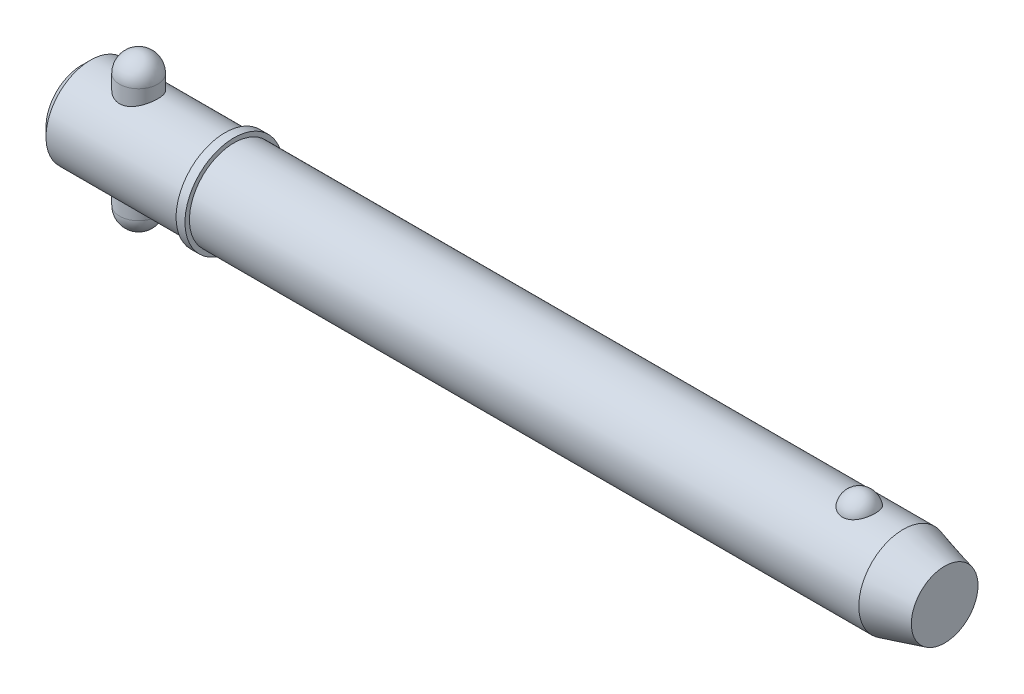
ISO-10303-21;
HEADER;
FILE_DESCRIPTION(('STEP AP214'),'2;1');
FILE_NAME('part.step','',(''),(''),'','','');
FILE_SCHEMA(('AUTOMOTIVE_DESIGN { 1 0 10303 214 1 1 1 1 }'));
ENDSEC;
DATA;
#1=APPLICATION_CONTEXT('core data for automotive mechanical design processes');
#2=APPLICATION_PROTOCOL_DEFINITION('international standard','automotive_design',2000,#1);
#3=PRODUCT_CONTEXT('',#1,'mechanical');
#4=PRODUCT('Part','Part','',(#3));
#5=PRODUCT_RELATED_PRODUCT_CATEGORY('part','',(#4));
#6=PRODUCT_DEFINITION_FORMATION('','',#4);
#7=PRODUCT_DEFINITION_CONTEXT('part definition',#1,'design');
#8=PRODUCT_DEFINITION('design','',#6,#7);
#9=PRODUCT_DEFINITION_SHAPE('','',#8);
#10=(LENGTH_UNIT() NAMED_UNIT(*) SI_UNIT(.MILLI.,.METRE.));
#11=(NAMED_UNIT(*) PLANE_ANGLE_UNIT() SI_UNIT($,.RADIAN.));
#12=(NAMED_UNIT(*) SI_UNIT($,.STERADIAN.) SOLID_ANGLE_UNIT());
#13=UNCERTAINTY_MEASURE_WITH_UNIT(LENGTH_MEASURE(1.E-05),#10,'distance_accuracy_value','');
#14=(GEOMETRIC_REPRESENTATION_CONTEXT(3) GLOBAL_UNCERTAINTY_ASSIGNED_CONTEXT((#13)) GLOBAL_UNIT_ASSIGNED_CONTEXT((#10,
#11,#12)) REPRESENTATION_CONTEXT('',''));
#15=CARTESIAN_POINT('',(0.,0.,0.));
#16=DIRECTION('',(0.,0.,1.));
#17=DIRECTION('',(1.,0.,0.));
#18=AXIS2_PLACEMENT_3D('',#15,#16,#17);
#19=CARTESIAN_POINT('',(14.28,19.05,0.));
#20=DIRECTION('',(0.,-1.,0.));
#21=DIRECTION('',(0.,0.,-1.));
#22=AXIS2_PLACEMENT_3D('',#19,#20,#21);
#23=CYLINDRICAL_SURFACE('',#22,4.76);
#24=CARTESIAN_POINT('',(14.28,-14.29,0.));
#25=DIRECTION('',(0.,-1.,0.));
#26=DIRECTION('',(0.,0.,-1.));
#27=AXIS2_PLACEMENT_3D('',#24,#25,#26);
#28=CIRCLE('',#27,4.76);
#29=CARTESIAN_POINT('',(14.28,-14.29,-4.76));
#30=VERTEX_POINT('',#29);
#31=EDGE_CURVE('P0_E10',#30,#30,#28,.F.);
#32=CARTESIAN_POINT('',(14.28,14.29,0.));
#33=DIRECTION('',(0.,-1.,0.));
#34=DIRECTION('',(0.,0.,-1.));
#35=AXIS2_PLACEMENT_3D('',#32,#33,#34);
#36=CIRCLE('',#35,4.76);
#37=CARTESIAN_POINT('',(14.28,14.29,-4.76));
#38=VERTEX_POINT('',#37);
#39=EDGE_CURVE('P0_E21',#38,#38,#36,.T.);
#40=CARTESIAN_POINT('',(14.28,-14.29,-4.76));
#41=CARTESIAN_POINT('',(14.28,-13.9922916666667,-4.76));
#42=CARTESIAN_POINT('',(14.28,-13.6945833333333,-4.76));
#43=CARTESIAN_POINT('',(14.28,-13.0991666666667,-4.76));
#44=CARTESIAN_POINT('',(14.28,-12.8014583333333,-4.76));
#45=CARTESIAN_POINT('',(14.28,-12.2060416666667,-4.76));
#46=CARTESIAN_POINT('',(14.28,-11.9083333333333,-4.76));
#47=CARTESIAN_POINT('',(14.28,-11.3129166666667,-4.76));
#48=CARTESIAN_POINT('',(14.28,-11.0152083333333,-4.76));
#49=CARTESIAN_POINT('',(14.28,-10.4197916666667,-4.76));
#50=CARTESIAN_POINT('',(14.28,-10.1220833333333,-4.76));
#51=CARTESIAN_POINT('',(14.28,-9.52666666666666,-4.76));
#52=CARTESIAN_POINT('',(14.28,-9.22895833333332,-4.76));
#53=CARTESIAN_POINT('',(14.28,-8.63354166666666,-4.76));
#54=CARTESIAN_POINT('',(14.28,-8.33583333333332,-4.76));
#55=CARTESIAN_POINT('',(14.28,-7.74041666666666,-4.76));
#56=CARTESIAN_POINT('',(14.28,-7.44270833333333,-4.76));
#57=CARTESIAN_POINT('',(14.28,-6.84729166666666,-4.76));
#58=CARTESIAN_POINT('',(14.28,-6.54958333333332,-4.76));
#59=CARTESIAN_POINT('',(14.28,-5.95416666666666,-4.76));
#60=CARTESIAN_POINT('',(14.28,-5.65645833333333,-4.76));
#61=CARTESIAN_POINT('',(14.28,-5.06104166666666,-4.76));
#62=CARTESIAN_POINT('',(14.28,-4.76333333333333,-4.76));
#63=CARTESIAN_POINT('',(14.28,-4.16791666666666,-4.76));
#64=CARTESIAN_POINT('',(14.28,-3.87020833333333,-4.76));
#65=CARTESIAN_POINT('',(14.28,-3.27479166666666,-4.76));
#66=CARTESIAN_POINT('',(14.28,-2.97708333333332,-4.76));
#67=CARTESIAN_POINT('',(14.28,-2.38166666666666,-4.76));
#68=CARTESIAN_POINT('',(14.28,-2.08395833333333,-4.76));
#69=CARTESIAN_POINT('',(14.28,-1.48854166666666,-4.76));
#70=CARTESIAN_POINT('',(14.28,-1.19083333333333,-4.76));
#71=CARTESIAN_POINT('',(14.28,-0.595416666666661,-4.76));
#72=CARTESIAN_POINT('',(14.28,-0.297708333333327,-4.76));
#73=CARTESIAN_POINT('',(14.28,0.297708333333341,-4.76));
#74=CARTESIAN_POINT('',(14.28,0.595416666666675,-4.76));
#75=CARTESIAN_POINT('',(14.28,1.19083333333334,-4.76));
#76=CARTESIAN_POINT('',(14.28,1.48854166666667,-4.76));
#77=CARTESIAN_POINT('',(14.28,2.08395833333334,-4.76));
#78=CARTESIAN_POINT('',(14.28,2.38166666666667,-4.76));
#79=CARTESIAN_POINT('',(14.28,2.97708333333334,-4.76));
#80=CARTESIAN_POINT('',(14.28,3.27479166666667,-4.76));
#81=CARTESIAN_POINT('',(14.28,3.87020833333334,-4.76));
#82=CARTESIAN_POINT('',(14.28,4.16791666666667,-4.76));
#83=CARTESIAN_POINT('',(14.28,4.76333333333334,-4.76));
#84=CARTESIAN_POINT('',(14.28,5.06104166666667,-4.76));
#85=CARTESIAN_POINT('',(14.28,5.65645833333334,-4.76));
#86=CARTESIAN_POINT('',(14.28,5.95416666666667,-4.76));
#87=CARTESIAN_POINT('',(14.28,6.54958333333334,-4.76));
#88=CARTESIAN_POINT('',(14.28,6.84729166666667,-4.76));
#89=CARTESIAN_POINT('',(14.28,7.44270833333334,-4.76));
#90=CARTESIAN_POINT('',(14.28,7.74041666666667,-4.76));
#91=CARTESIAN_POINT('',(14.28,8.33583333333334,-4.76));
#92=CARTESIAN_POINT('',(14.28,8.63354166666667,-4.76));
#93=CARTESIAN_POINT('',(14.28,9.22895833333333,-4.76));
#94=CARTESIAN_POINT('',(14.28,9.52666666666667,-4.76));
#95=CARTESIAN_POINT('',(14.28,10.1220833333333,-4.76));
#96=CARTESIAN_POINT('',(14.28,10.4197916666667,-4.76));
#97=CARTESIAN_POINT('',(14.28,11.0152083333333,-4.76));
#98=CARTESIAN_POINT('',(14.28,11.3129166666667,-4.76));
#99=CARTESIAN_POINT('',(14.28,11.9083333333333,-4.76));
#100=CARTESIAN_POINT('',(14.28,12.2060416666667,-4.76));
#101=CARTESIAN_POINT('',(14.28,12.8014583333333,-4.76));
#102=CARTESIAN_POINT('',(14.28,13.0991666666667,-4.76));
#103=CARTESIAN_POINT('',(14.28,13.6945833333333,-4.76));
#104=CARTESIAN_POINT('',(14.28,13.9922916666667,-4.76));
#105=CARTESIAN_POINT('',(14.28,14.29,-4.76));
#106=B_SPLINE_CURVE_WITH_KNOTS('',3,(#40,#41,#42,#43,#44,#45,#46,#47,#48,#49,#50,#51,#52,#53,
#54,#55,#56,#57,#58,#59,#60,#61,#62,#63,#64,#65,#66,#67,#68,#69,#70,#71,#72,#73,#74,#75,#76,#77,
#78,#79,#80,#81,#82,#83,#84,#85,#86,#87,#88,#89,#90,#91,#92,#93,#94,#95,#96,#97,#98,#99,#100,
#101,#102,#103,#104,#105),.UNSPECIFIED.,.F.,.F.,(4,2,2,2,2,2,2,2,2,2,2,2,2,2,2,2,2,2,2,2,2,2,2,
2,2,2,2,2,2,2,2,2,4),(0.,0.893125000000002,1.78625,2.67937499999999,3.5725,4.465625,5.35875,
6.25187499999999,7.145,8.038125,8.93125,9.82437499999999,10.7175,11.610625,12.50375,13.396875,
14.29,15.183125,16.07625,16.969375,17.8625,18.755625,19.64875,20.541875,21.435,22.328125,
23.22125,24.114375,25.0075,25.900625,26.79375,27.686875,28.58),.UNSPECIFIED.);
#107=EDGE_CURVE('P0_BSEAM14',#30,#38,#106,.T.);
#108=ORIENTED_EDGE('',*,*,#31,.T.);
#109=ORIENTED_EDGE('',*,*,#39,.T.);
#110=ORIENTED_EDGE('',*,*,#107,.T.);
#111=ORIENTED_EDGE('',*,*,#107,.F.);
#112=EDGE_LOOP('',(#108,#110,#109,#111));
#113=FACE_BOUND('',#112,.T.);
#114=ADVANCED_FACE('P0_F14',(#113),#23,.T.);
#115=CARTESIAN_POINT('',(14.28,-14.29,0.));
#116=DIRECTION('',(0.,0.,1.));
#117=DIRECTION('',(1.,0.,0.));
#118=AXIS2_PLACEMENT_3D('',#115,#116,#117);
#119=SPHERICAL_SURFACE('',#118,4.76);
#120=CARTESIAN_POINT('',(14.28,-14.29,0.));
#121=DIRECTION('',(0.,-1.,0.));
#122=DIRECTION('',(0.,0.,-1.));
#123=AXIS2_PLACEMENT_3D('',#120,#121,#122);
#124=SPHERICAL_SURFACE('',#123,4.76);
#125=ORIENTED_EDGE('',*,*,#31,.F.);
#126=EDGE_LOOP('',(#125));
#127=FACE_BOUND('',#126,.T.);
#128=ADVANCED_FACE('P0_F29',(#127),#124,.T.);
#129=CARTESIAN_POINT('',(14.28,14.29,0.));
#130=DIRECTION('',(0.,0.,1.));
#131=DIRECTION('',(1.,0.,0.));
#132=AXIS2_PLACEMENT_3D('',#129,#130,#131);
#133=SPHERICAL_SURFACE('',#132,4.76);
#134=CARTESIAN_POINT('',(14.28,14.29,0.));
#135=DIRECTION('',(0.,-1.,0.));
#136=DIRECTION('',(0.,0.,-1.));
#137=AXIS2_PLACEMENT_3D('',#134,#135,#136);
#138=SPHERICAL_SURFACE('',#137,4.76);
#139=ORIENTED_EDGE('',*,*,#39,.F.);
#140=EDGE_LOOP('',(#139));
#141=FACE_BOUND('',#140,.T.);
#142=ADVANCED_FACE('P0_F16',(#141),#138,.T.);
#143=CLOSED_SHELL('',(#114,#128,#142));
#144=MANIFOLD_SOLID_BREP('P0_B1',#143);
#145=CARTESIAN_POINT('',(0.,0.,0.));
#146=DIRECTION('',(1.,0.,0.));
#147=DIRECTION('',(0.,0.,-1.));
#148=AXIS2_PLACEMENT_3D('',#145,#146,#147);
#149=CYLINDRICAL_SURFACE('',#148,11.115);
#150=CARTESIAN_POINT('',(205.529563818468,0.,0.));
#151=DIRECTION('',(1.,0.,0.));
#152=DIRECTION('',(0.,0.,-1.));
#153=AXIS2_PLACEMENT_3D('',#150,#151,#152);
#154=CIRCLE('',#153,11.115);
#155=CARTESIAN_POINT('',(205.529563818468,0.,-11.115));
#156=VERTEX_POINT('',#155);
#157=EDGE_CURVE('P1_E81',#156,#156,#154,.T.);
#158=ORIENTED_EDGE('',*,*,#157,.F.);
#159=EDGE_LOOP('',(#158));
#160=FACE_BOUND('',#159,.T.);
#161=CARTESIAN_POINT('',(38.1,0.,0.));
#162=DIRECTION('',(1.,0.,0.));
#163=DIRECTION('',(0.,0.,-1.));
#164=AXIS2_PLACEMENT_3D('',#161,#162,#163);
#165=CIRCLE('',#164,11.115);
#166=CARTESIAN_POINT('',(38.1,0.,-11.115));
#167=VERTEX_POINT('',#166);
#168=EDGE_CURVE('P1_E85',#167,#167,#165,.T.);
#169=ORIENTED_EDGE('',*,*,#168,.T.);
#170=EDGE_LOOP('',(#169));
#171=FACE_BOUND('',#170,.T.);
#172=CARTESIAN_POINT('',(194.531068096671,10.3028087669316,4.17077409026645));
#173=CARTESIAN_POINT('',(194.314775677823,10.3028003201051,4.17078240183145));
#174=CARTESIAN_POINT('',(194.098548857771,10.3098895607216,4.15340593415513));
#175=CARTESIAN_POINT('',(193.672540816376,10.3373834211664,4.08449540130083));
#176=CARTESIAN_POINT('',(193.462757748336,10.3577841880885,4.0329712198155));
#177=CARTESIAN_POINT('',(193.055782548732,10.4095237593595,3.89746513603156));
#178=CARTESIAN_POINT('',(192.858572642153,10.4408466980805,3.81353029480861));
#179=CARTESIAN_POINT('',(192.481338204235,10.5110236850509,3.61560339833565));
#180=CARTESIAN_POINT('',(192.301317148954,10.5498792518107,3.50160528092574));
#181=CARTESIAN_POINT('',(191.957684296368,10.6322884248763,3.24292464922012));
#182=CARTESIAN_POINT('',(191.794686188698,10.6759443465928,3.09746040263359));
#183=CARTESIAN_POINT('',(191.494591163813,10.7625291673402,2.78171925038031));
#184=CARTESIAN_POINT('',(191.357499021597,10.8054579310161,2.61143778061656));
#185=CARTESIAN_POINT('',(191.106408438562,10.8881935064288,2.24226695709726));
#186=CARTESIAN_POINT('',(190.993710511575,10.9277761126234,2.04244123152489));
#187=CARTESIAN_POINT('',(190.801777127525,10.997484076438,1.62578254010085));
#188=CARTESIAN_POINT('',(190.722544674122,11.0276085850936,1.40894804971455));
#189=CARTESIAN_POINT('',(190.598303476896,11.0756732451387,0.961250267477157));
#190=CARTESIAN_POINT('',(190.553760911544,11.0934470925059,0.730239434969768));
#191=CARTESIAN_POINT('',(190.501569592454,11.1143331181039,0.263439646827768));
#192=CARTESIAN_POINT('',(190.493920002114,11.1174456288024,0.0276507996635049));
#193=CARTESIAN_POINT('',(190.51561056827,11.1087161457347,-0.440729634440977));
#194=CARTESIAN_POINT('',(190.544762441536,11.0969502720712,-0.673331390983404));
#195=CARTESIAN_POINT('',(190.639143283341,11.0597872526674,-1.12996621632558));
#196=CARTESIAN_POINT('',(190.704372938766,11.0343898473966,-1.35399912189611));
#197=CARTESIAN_POINT('',(190.86969844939,10.972515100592,-1.78750286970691));
#198=CARTESIAN_POINT('',(190.96983863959,10.9360236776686,-1.99695478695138));
#199=CARTESIAN_POINT('',(191.202940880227,10.8557595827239,-2.39520667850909));
#200=CARTESIAN_POINT('',(191.335905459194,10.8119863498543,-2.58400506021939));
#201=CARTESIAN_POINT('',(191.632407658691,10.7216733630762,-2.93635726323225));
#202=CARTESIAN_POINT('',(191.796056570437,10.675123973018,-3.09981510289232));
#203=CARTESIAN_POINT('',(192.149860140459,10.5846571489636,-3.39592247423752));
#204=CARTESIAN_POINT('',(192.340012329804,10.5407394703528,-3.52857487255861));
#205=CARTESIAN_POINT('',(192.73750141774,10.4616690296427,-3.75646057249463));
#206=CARTESIAN_POINT('',(192.94436705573,10.4263443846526,-3.85245432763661));
#207=CARTESIAN_POINT('',(193.372954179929,10.3675574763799,-4.00798747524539));
#208=CARTESIAN_POINT('',(193.594670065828,10.3440907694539,-4.06754052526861));
#209=CARTESIAN_POINT('',(194.034669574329,10.3128282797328,-4.14614314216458));
#210=CARTESIAN_POINT('',(194.252565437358,10.3043040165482,-4.1670783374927));
#211=CARTESIAN_POINT('',(194.68894951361,10.3016771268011,-4.17357158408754));
#212=CARTESIAN_POINT('',(194.907437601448,10.3075716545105,-4.15913661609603));
#213=CARTESIAN_POINT('',(195.331744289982,10.3326686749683,-4.09636961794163));
#214=CARTESIAN_POINT('',(195.537745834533,10.3514555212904,-4.0490957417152));
#215=CARTESIAN_POINT('',(195.938576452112,10.399818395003,-3.92320197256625));
#216=CARTESIAN_POINT('',(196.1334046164,10.4293952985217,-3.84457953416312));
#217=CARTESIAN_POINT('',(196.511191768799,10.4969600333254,-3.65612410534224));
#218=CARTESIAN_POINT('',(196.693797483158,10.5351178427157,-3.54564545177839));
#219=CARTESIAN_POINT('',(197.038204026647,10.6154999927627,-3.29718036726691));
#220=CARTESIAN_POINT('',(197.200000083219,10.657725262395,-3.15918764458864));
#221=CARTESIAN_POINT('',(197.506959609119,10.744212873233,-2.85163580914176));
#222=CARTESIAN_POINT('',(197.650891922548,10.7884718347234,-2.68084605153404));
#223=CARTESIAN_POINT('',(197.909237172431,10.872374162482,-2.31721864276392));
#224=CARTESIAN_POINT('',(198.023644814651,10.9120167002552,-2.12437704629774));
#225=CARTESIAN_POINT('',(198.223873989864,10.9838919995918,-1.71516999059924));
#226=CARTESIAN_POINT('',(198.30866178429,11.0158465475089,-1.49824866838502));
#227=CARTESIAN_POINT('',(198.44268382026,11.0673523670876,-1.05228572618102));
#228=CARTESIAN_POINT('',(198.491917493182,11.086903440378,-0.82324391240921));
#229=CARTESIAN_POINT('',(198.553891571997,11.1116323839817,-0.359087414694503));
#230=CARTESIAN_POINT('',(198.566566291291,11.1167843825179,-0.123962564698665));
#231=CARTESIAN_POINT('',(198.554973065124,11.1121144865,0.345220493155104));
#232=CARTESIAN_POINT('',(198.530705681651,11.1022928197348,0.579278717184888));
#233=CARTESIAN_POINT('',(198.445907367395,11.0687504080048,1.03866534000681));
#234=CARTESIAN_POINT('',(198.385529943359,11.0450885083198,1.26402641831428));
#235=CARTESIAN_POINT('',(198.229853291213,10.9863185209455,1.70076772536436));
#236=CARTESIAN_POINT('',(198.134551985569,10.9512097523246,1.91214712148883));
#237=CARTESIAN_POINT('',(197.910397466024,10.8729733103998,2.316083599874));
#238=CARTESIAN_POINT('',(197.781380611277,10.8298068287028,2.50854240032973));
#239=CARTESIAN_POINT('',(197.492732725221,10.7401896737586,2.86808766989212));
#240=CARTESIAN_POINT('',(197.333102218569,10.6937390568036,3.03517457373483));
#241=CARTESIAN_POINT('',(196.987534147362,10.6029321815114,3.33857581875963));
#242=CARTESIAN_POINT('',(196.801708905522,10.5585680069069,3.47501541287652));
#243=CARTESIAN_POINT('',(196.407875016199,10.4769321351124,3.71390897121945));
#244=CARTESIAN_POINT('',(196.199863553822,10.439661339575,3.81635861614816));
#245=CARTESIAN_POINT('',(195.754066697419,10.3749407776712,3.98910631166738));
#246=CARTESIAN_POINT('',(195.515234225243,10.3482457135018,4.05700929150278));
#247=CARTESIAN_POINT('',(195.027925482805,10.312188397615,4.14782844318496));
#248=CARTESIAN_POINT('',(194.779453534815,10.3028184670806,4.17076454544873));
#249=CARTESIAN_POINT('',(194.531068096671,10.3028087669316,4.17077409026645));
#250=B_SPLINE_CURVE_WITH_KNOTS('',3,(#172,#173,#174,#175,#176,#177,#178,#179,#180,#181,#182,
#183,#184,#185,#186,#187,#188,#189,#190,#191,#192,#193,#194,#195,#196,#197,#198,#199,#200,#201,
#202,#203,#204,#205,#206,#207,#208,#209,#210,#211,#212,#213,#214,#215,#216,#217,#218,#219,#220,
#221,#222,#223,#224,#225,#226,#227,#228,#229,#230,#231,#232,#233,#234,#235,#236,#237,#238,#239,
#240,#241,#242,#243,#244,#245,#246,#247,#248,#249),.UNSPECIFIED.,.T.,.F.,(4,2,2,2,2,2,2,2,2,2,2,
2,2,2,2,2,2,2,2,2,2,2,2,2,2,2,2,2,2,2,2,2,2,2,2,2,2,2,4),(0.,0.64796614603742,1.29574482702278,
1.94258643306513,2.58955857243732,3.25496465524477,3.92049326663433,4.61566368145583,
5.31089647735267,6.01531821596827,6.71972398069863,7.42054043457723,8.12137023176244,
8.82309331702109,9.5248704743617,10.2292439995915,10.9335519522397,11.6223330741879,
12.3108558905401,12.9647664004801,13.6185478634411,14.252184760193,14.8858731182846,
15.5334360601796,16.1811472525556,16.8611459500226,17.5412664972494,18.2431855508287,
18.9451158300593,19.6483065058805,20.3514864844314,21.0516982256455,21.7519516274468,
22.4556690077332,23.1593743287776,23.8601491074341,24.5610129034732,25.3054529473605,
26.049562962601),.UNSPECIFIED.);
#251=CARTESIAN_POINT('',(194.531068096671,10.3028087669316,4.17077409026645));
#252=VERTEX_POINT('',#251);
#253=EDGE_CURVE('P1_E35',#252,#252,#250,.T.);
#254=ORIENTED_EDGE('',*,*,#253,.T.);
#255=EDGE_LOOP('',(#254));
#256=FACE_BOUND('',#255,.T.);
#257=ADVANCED_FACE('P1_F13',(#160,#171,#256),#149,.T.);
#258=CARTESIAN_POINT('',(0.,0.,0.));
#259=DIRECTION('',(-1.,0.,0.));
#260=DIRECTION('',(0.,0.,1.));
#261=AXIS2_PLACEMENT_3D('',#258,#259,#260);
#262=PLANE('',#261);
#263=CARTESIAN_POINT('',(0.,0.,0.));
#264=DIRECTION('',(1.,0.,0.));
#265=DIRECTION('',(0.,0.,-1.));
#266=AXIS2_PLACEMENT_3D('',#263,#264,#265);
#267=CIRCLE('',#266,8.892);
#268=CARTESIAN_POINT('',(0.,0.,-8.892));
#269=VERTEX_POINT('',#268);
#270=EDGE_CURVE('P1_E9',#269,#269,#267,.T.);
#271=ORIENTED_EDGE('',*,*,#270,.F.);
#272=EDGE_LOOP('',(#271));
#273=FACE_BOUND('',#272,.T.);
#274=ADVANCED_FACE('P1_F15',(#273),#262,.T.);
#275=CARTESIAN_POINT('',(2.22299999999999,0.,0.));
#276=DIRECTION('',(1.,0.,0.));
#277=DIRECTION('',(0.,0.,-1.));
#278=AXIS2_PLACEMENT_3D('',#275,#276,#277);
#279=CONICAL_SURFACE('',#278,11.115,0.78539816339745);
#280=ORIENTED_EDGE('',*,*,#270,.T.);
#281=EDGE_LOOP('',(#280));
#282=FACE_BOUND('',#281,.T.);
#283=CARTESIAN_POINT('',(2.22299999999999,0.,0.));
#284=DIRECTION('',(1.,0.,0.));
#285=DIRECTION('',(0.,0.,-1.));
#286=AXIS2_PLACEMENT_3D('',#283,#284,#285);
#287=CIRCLE('',#286,11.115);
#288=CARTESIAN_POINT('',(2.22299999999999,0.,-11.115));
#289=VERTEX_POINT('',#288);
#290=EDGE_CURVE('P1_E26',#289,#289,#287,.T.);
#291=ORIENTED_EDGE('',*,*,#290,.F.);
#292=EDGE_LOOP('',(#291));
#293=FACE_BOUND('',#292,.T.);
#294=ADVANCED_FACE('P1_F77',(#282,#293),#279,.T.);
#295=CARTESIAN_POINT('',(0.,0.,0.));
#296=DIRECTION('',(1.,0.,0.));
#297=DIRECTION('',(0.,0.,-1.));
#298=AXIS2_PLACEMENT_3D('',#295,#296,#297);
#299=CYLINDRICAL_SURFACE('',#298,11.115);
#300=CARTESIAN_POINT('',(14.28,-10.0441836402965,4.76));
#301=CARTESIAN_POINT('',(14.1533731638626,-10.0441846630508,4.75999904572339));
#302=CARTESIAN_POINT('',(14.0267055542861,-10.0465865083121,4.75493985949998));
#303=CARTESIAN_POINT('',(13.774298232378,-10.0561141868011,4.73475585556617));
#304=CARTESIAN_POINT('',(13.6485591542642,-10.0632429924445,4.71962470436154));
#305=CARTESIAN_POINT('',(13.3987500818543,-10.0819979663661,4.67942666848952));
#306=CARTESIAN_POINT('',(13.2746840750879,-10.0936334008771,4.65433930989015));
#307=CARTESIAN_POINT('',(13.0293244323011,-10.1210146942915,4.59449317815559));
#308=CARTESIAN_POINT('',(12.9080319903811,-10.1367622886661,4.55973032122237));
#309=CARTESIAN_POINT('',(12.669614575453,-10.1717810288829,4.48106435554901));
#310=CARTESIAN_POINT('',(12.5524727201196,-10.1910352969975,4.4372048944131));
#311=CARTESIAN_POINT('',(12.3224300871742,-10.2325403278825,4.34063417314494));
#312=CARTESIAN_POINT('',(12.2095309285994,-10.2547922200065,4.28791957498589));
#313=CARTESIAN_POINT('',(11.8782785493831,-10.3250879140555,4.11715127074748));
#314=CARTESIAN_POINT('',(11.6670799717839,-10.3767168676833,3.98637638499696));
#315=CARTESIAN_POINT('',(11.2564039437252,-10.4874309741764,3.68567149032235));
#316=CARTESIAN_POINT('',(11.0583793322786,-10.5467772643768,3.51386978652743));
#317=CARTESIAN_POINT('',(10.6927724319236,-10.6641377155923,3.13969960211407));
#318=CARTESIAN_POINT('',(10.5252022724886,-10.7221513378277,2.93731900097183));
#319=CARTESIAN_POINT('',(10.2965609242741,-10.8050020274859,2.60935726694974));
#320=CARTESIAN_POINT('',(10.2227768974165,-10.8324811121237,2.49310321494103));
#321=CARTESIAN_POINT('',(10.0853380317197,-10.884703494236,2.25418999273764));
#322=CARTESIAN_POINT('',(10.0216789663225,-10.9094479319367,2.13153352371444));
#323=CARTESIAN_POINT('',(9.90506238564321,-10.9554932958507,1.88060370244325));
#324=CARTESIAN_POINT('',(9.85210574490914,-10.9767939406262,1.7523298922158));
#325=CARTESIAN_POINT('',(9.75746464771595,-11.0153112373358,1.49115740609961));
#326=CARTESIAN_POINT('',(9.71577447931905,-11.0325299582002,1.35826111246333));
#327=CARTESIAN_POINT('',(9.64605475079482,-11.0615607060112,1.09614539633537));
#328=CARTESIAN_POINT('',(9.61740732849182,-11.0736151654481,0.96711700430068));
#329=CARTESIAN_POINT('',(9.57092026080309,-11.0932687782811,0.706847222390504));
#330=CARTESIAN_POINT('',(9.55307574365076,-11.1008699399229,0.575606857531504));
#331=CARTESIAN_POINT('',(9.52838640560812,-11.1114054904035,0.31192917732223));
#332=CARTESIAN_POINT('',(9.52153986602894,-11.114340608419,0.179492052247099));
#333=CARTESIAN_POINT('',(9.51892405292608,-11.1154607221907,-0.0855090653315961));
#334=CARTESIAN_POINT('',(9.52315432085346,-11.1136459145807,-0.218073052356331));
#335=CARTESIAN_POINT('',(9.542009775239,-11.1055891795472,-0.473709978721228));
#336=CARTESIAN_POINT('',(9.55594693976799,-11.099640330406,-0.596843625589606));
#337=CARTESIAN_POINT('',(9.59332832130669,-11.0837823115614,-0.841440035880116));
#338=CARTESIAN_POINT('',(9.61677567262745,-11.0738718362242,-0.962902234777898));
#339=CARTESIAN_POINT('',(9.67294089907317,-11.0503378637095,-1.20325684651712));
#340=CARTESIAN_POINT('',(9.70565569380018,-11.0367156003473,-1.32215009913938));
#341=CARTESIAN_POINT('',(9.78005008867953,-11.0060908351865,-1.55666640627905));
#342=CARTESIAN_POINT('',(9.82173311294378,-10.9890870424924,-1.67228819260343));
#343=CARTESIAN_POINT('',(9.96110379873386,-10.9330280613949,-2.01656166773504));
#344=CARTESIAN_POINT('',(10.0722987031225,-10.8892801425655,-2.23915547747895));
#345=CARTESIAN_POINT('',(10.3268588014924,-10.7934745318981,-2.66299199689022));
#346=CARTESIAN_POINT('',(10.4702355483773,-10.7414138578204,-2.86422700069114));
#347=CARTESIAN_POINT('',(10.7973904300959,-10.6296201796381,-3.25557775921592));
#348=CARTESIAN_POINT('',(10.9833705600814,-10.569604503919,-3.443774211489));
#349=CARTESIAN_POINT('',(11.3844486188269,-10.4514707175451,-3.78722133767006));
#350=CARTESIAN_POINT('',(11.5995590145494,-10.3933534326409,-3.94245783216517));
#351=CARTESIAN_POINT('',(11.9444340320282,-10.311516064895,-4.14990014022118));
#352=CARTESIAN_POINT('',(12.0654579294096,-10.2847012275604,-4.21573894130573));
#353=CARTESIAN_POINT('',(12.3132718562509,-10.2342051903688,-4.33688518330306));
#354=CARTESIAN_POINT('',(12.4400593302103,-10.2105226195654,-4.39219723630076));
#355=CARTESIAN_POINT('',(12.6985418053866,-10.1671237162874,-4.49174500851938));
#356=CARTESIAN_POINT('',(12.8302359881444,-10.1474067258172,-4.53598256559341));
#357=CARTESIAN_POINT('',(13.0975061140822,-10.1126841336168,-4.61287629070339));
#358=CARTESIAN_POINT('',(13.233079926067,-10.0976759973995,-4.64553869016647));
#359=CARTESIAN_POINT('',(13.4978553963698,-10.0737863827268,-4.6971059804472));
#360=CARTESIAN_POINT('',(13.6268754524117,-10.0645618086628,-4.716785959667));
#361=CARTESIAN_POINT('',(13.8862990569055,-10.051062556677,-4.74548419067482));
#362=CARTESIAN_POINT('',(14.0167019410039,-10.0467856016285,-4.75450734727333));
#363=CARTESIAN_POINT('',(14.277859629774,-10.0433352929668,-4.76179143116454));
#364=CARTESIAN_POINT('',(14.4086143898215,-10.0441613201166,-4.76005366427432));
#365=CARTESIAN_POINT('',(14.6694025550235,-10.0508838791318,-4.74584231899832));
#366=CARTESIAN_POINT('',(14.7994359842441,-10.0567802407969,-4.73336910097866));
#367=CARTESIAN_POINT('',(15.0487369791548,-10.0728449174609,-4.69907984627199));
#368=CARTESIAN_POINT('',(15.1681238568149,-10.0826872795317,-4.67797462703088));
#369=CARTESIAN_POINT('',(15.4045894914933,-10.1062580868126,-4.62682977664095));
#370=CARTESIAN_POINT('',(15.5216674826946,-10.1199877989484,-4.59678723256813));
#371=CARTESIAN_POINT('',(15.868278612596,-10.1664161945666,-4.49365911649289));
#372=CARTESIAN_POINT('',(16.0933756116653,-10.2043671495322,-4.40754694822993));
#373=CARTESIAN_POINT('',(16.5357981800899,-10.2919879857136,-4.19898201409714));
#374=CARTESIAN_POINT('',(16.7523611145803,-10.3420954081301,-4.07511281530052));
#375=CARTESIAN_POINT('',(17.1627188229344,-10.4477911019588,-3.7959429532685));
#376=CARTESIAN_POINT('',(17.3565033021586,-10.5033818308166,-3.64062816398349));
#377=CARTESIAN_POINT('',(17.7334034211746,-10.6196376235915,-3.28693729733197));
#378=CARTESIAN_POINT('',(17.9141276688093,-10.6803237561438,-3.08599175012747));
#379=CARTESIAN_POINT('',(18.1582189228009,-10.7666348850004,-2.76320365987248));
#380=CARTESIAN_POINT('',(18.2351223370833,-10.7946346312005,-2.65197124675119));
#381=CARTESIAN_POINT('',(18.3793967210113,-10.8483267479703,-2.42297927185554));
#382=CARTESIAN_POINT('',(18.4467718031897,-10.87402011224,-2.30522255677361));
#383=CARTESIAN_POINT('',(18.5717669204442,-10.9225249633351,-2.06324665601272));
#384=CARTESIAN_POINT('',(18.6293326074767,-10.9453202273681,-1.93899615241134));
#385=CARTESIAN_POINT('',(18.73370006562,-10.9872100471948,-1.6855059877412));
#386=CARTESIAN_POINT('',(18.7805065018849,-11.0063062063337,-1.55626851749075));
#387=CARTESIAN_POINT('',(18.8628731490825,-11.0402419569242,-1.29375150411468));
#388=CARTESIAN_POINT('',(18.8984366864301,-11.0550828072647,-1.16047316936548));
#389=CARTESIAN_POINT('',(18.9579183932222,-11.0800638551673,-0.890912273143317));
#390=CARTESIAN_POINT('',(18.9818374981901,-11.0902044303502,-0.75462995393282));
#391=CARTESIAN_POINT('',(19.0164177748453,-11.104911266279,-0.490295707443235));
#392=CARTESIAN_POINT('',(19.027922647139,-11.1098318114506,-0.362373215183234));
#393=CARTESIAN_POINT('',(19.040554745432,-11.1152360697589,-0.105876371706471));
#394=CARTESIAN_POINT('',(19.0416784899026,-11.1157182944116,0.0226981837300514));
#395=CARTESIAN_POINT('',(19.0335275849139,-11.1122291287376,0.27938352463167));
#396=CARTESIAN_POINT('',(19.0242587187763,-11.1082602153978,0.407494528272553));
#397=CARTESIAN_POINT('',(18.9954320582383,-11.0959792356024,0.662388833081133));
#398=CARTESIAN_POINT('',(18.9758704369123,-11.0876655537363,0.789171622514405));
#399=CARTESIAN_POINT('',(18.9276379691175,-11.0673259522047,1.03545890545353));
#400=CARTESIAN_POINT('',(18.8993573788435,-11.0554596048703,1.15505309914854));
#401=CARTESIAN_POINT('',(18.8337694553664,-11.0282166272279,1.39134516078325));
#402=CARTESIAN_POINT('',(18.7964589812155,-11.0128387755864,1.5080420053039));
#403=CARTESIAN_POINT('',(18.671464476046,-10.9619666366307,1.85262797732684));
#404=CARTESIAN_POINT('',(18.5706772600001,-10.9217161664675,2.07521484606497));
#405=CARTESIAN_POINT('',(18.33202463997,-10.8301378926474,2.51061719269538));
#406=CARTESIAN_POINT('',(18.1926775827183,-10.7783885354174,2.72252375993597));
#407=CARTESIAN_POINT('',(17.8829747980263,-10.669863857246,3.12088015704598));
#408=CARTESIAN_POINT('',(17.7126068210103,-10.6130865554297,3.30731987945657));
#409=CARTESIAN_POINT('',(17.3310036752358,-10.495668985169,3.66358491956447));
#410=CARTESIAN_POINT('',(17.1177010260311,-10.4350471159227,3.83122543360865));
#411=CARTESIAN_POINT('',(16.7778915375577,-10.3495418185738,4.05420569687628));
#412=CARTESIAN_POINT('',(16.6612023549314,-10.3219229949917,4.12383380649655));
#413=CARTESIAN_POINT('',(16.4218466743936,-10.2693487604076,4.25306463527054));
#414=CARTESIAN_POINT('',(16.2991829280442,-10.2443921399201,4.31267191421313));
#415=CARTESIAN_POINT('',(16.0488008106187,-10.1979981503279,4.42126071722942));
#416=CARTESIAN_POINT('',(15.9210894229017,-10.1765561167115,4.47025635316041));
#417=CARTESIAN_POINT('',(15.6613937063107,-10.1379191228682,4.55720152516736));
#418=CARTESIAN_POINT('',(15.5294115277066,-10.1207220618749,4.59515652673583));
#419=CARTESIAN_POINT('',(15.2624981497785,-10.091252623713,4.65951684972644));
#420=CARTESIAN_POINT('',(15.1275757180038,-10.0789672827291,4.68595259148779));
#421=CARTESIAN_POINT('',(14.8556442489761,-10.0597530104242,4.72706206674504));
#422=CARTESIAN_POINT('',(14.7186368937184,-10.0528199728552,4.74174481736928));
#423=CARTESIAN_POINT('',(14.5310955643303,-10.047196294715,4.75363843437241));
#424=CARTESIAN_POINT('',(14.48091543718,-10.0460674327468,4.75602323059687));
#425=CARTESIAN_POINT('',(14.3804923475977,-10.044560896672,4.7592042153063));
#426=CARTESIAN_POINT('',(14.3302493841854,-10.0441832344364,4.76000037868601));
#427=CARTESIAN_POINT('',(14.28,-10.0441836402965,4.76));
#428=B_SPLINE_CURVE_WITH_KNOTS('',3,(#300,#301,#302,#303,#304,#305,#306,#307,#308,#309,#310,
#311,#312,#313,#314,#315,#316,#317,#318,#319,#320,#321,#322,#323,#324,#325,#326,#327,#328,#329,
#330,#331,#332,#333,#334,#335,#336,#337,#338,#339,#340,#341,#342,#343,#344,#345,#346,#347,#348,
#349,#350,#351,#352,#353,#354,#355,#356,#357,#358,#359,#360,#361,#362,#363,#364,#365,#366,#367,
#368,#369,#370,#371,#372,#373,#374,#375,#376,#377,#378,#379,#380,#381,#382,#383,#384,#385,#386,
#387,#388,#389,#390,#391,#392,#393,#394,#395,#396,#397,#398,#399,#400,#401,#402,#403,#404,#405,
#406,#407,#408,#409,#410,#411,#412,#413,#414,#415,#416,#417,#418,#419,#420,#421,#422,#423,#424,
#425,#426,#427),.UNSPECIFIED.,.T.,.F.,(4,2,2,2,2,2,2,2,2,2,2,2,2,2,2,2,2,2,2,2,2,2,2,2,2,2,2,2,
2,2,2,2,2,2,2,2,2,2,2,2,2,2,2,2,2,2,2,2,2,2,2,2,2,2,2,2,2,2,2,2,2,2,2,4),(0.,0.379828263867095,
0.759895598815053,1.14074858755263,1.52176256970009,1.90098898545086,2.28035867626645,
3.03818035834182,3.84125131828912,4.6446414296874,5.06541657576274,5.48601561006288,
5.90664899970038,6.3270687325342,6.72470503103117,7.12216187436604,7.51955659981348,
7.91693487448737,8.28868404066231,8.66055582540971,9.03230414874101,9.40419465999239,
10.1585834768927,10.9132435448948,11.7236471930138,12.5343987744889,12.9550196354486,
13.3754557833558,13.7958221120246,14.2159617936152,14.6079540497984,14.9997658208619,
15.3915300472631,15.7832811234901,16.1477615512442,16.512360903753,17.240999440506,
18.0012974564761,18.761937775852,19.5886929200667,20.0025782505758,20.4162843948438,
20.832212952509,21.2479608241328,21.6635855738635,22.0791769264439,22.4642880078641,
22.8495282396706,23.2345541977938,23.6197234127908,23.9896813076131,24.3597680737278,
25.099327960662,25.8726239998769,26.6462260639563,27.4759193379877,27.8914891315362,
28.3068693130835,28.7216936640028,29.1363123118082,29.5498292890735,29.9630287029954,
30.113753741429,30.2644811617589),.UNSPECIFIED.);
#429=CARTESIAN_POINT('',(14.28,-10.0441836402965,4.76));
#430=VERTEX_POINT('',#429);
#431=EDGE_CURVE('P1_E17',#430,#430,#428,.T.);
#432=ORIENTED_EDGE('',*,*,#431,.F.);
#433=EDGE_LOOP('',(#432));
#434=FACE_BOUND('',#433,.T.);
#435=CARTESIAN_POINT('',(14.28,10.0441836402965,4.76));
#436=CARTESIAN_POINT('',(14.4066268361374,10.0441846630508,4.75999904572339));
#437=CARTESIAN_POINT('',(14.5332944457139,10.0465865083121,4.75493985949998));
#438=CARTESIAN_POINT('',(14.785701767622,10.0561141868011,4.73475585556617));
#439=CARTESIAN_POINT('',(14.9114408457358,10.0632429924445,4.71962470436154));
#440=CARTESIAN_POINT('',(15.1612499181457,10.0819979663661,4.67942666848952));
#441=CARTESIAN_POINT('',(15.2853159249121,10.0936334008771,4.65433930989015));
#442=CARTESIAN_POINT('',(15.5306755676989,10.1210146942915,4.59449317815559));
#443=CARTESIAN_POINT('',(15.6519680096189,10.1367622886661,4.55973032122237));
#444=CARTESIAN_POINT('',(15.890385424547,10.1717810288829,4.48106435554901));
#445=CARTESIAN_POINT('',(16.0075272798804,10.1910352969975,4.4372048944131));
#446=CARTESIAN_POINT('',(16.2375699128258,10.2325403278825,4.34063417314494));
#447=CARTESIAN_POINT('',(16.3504690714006,10.2547922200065,4.28791957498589));
#448=CARTESIAN_POINT('',(16.6817214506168,10.3250879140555,4.11715127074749));
#449=CARTESIAN_POINT('',(16.8929200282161,10.3767168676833,3.98637638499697));
#450=CARTESIAN_POINT('',(17.3035960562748,10.4874309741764,3.68567149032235));
#451=CARTESIAN_POINT('',(17.5016206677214,10.5467772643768,3.51386978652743));
#452=CARTESIAN_POINT('',(17.8672275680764,10.6641377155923,3.13969960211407));
#453=CARTESIAN_POINT('',(18.0347977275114,10.7221513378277,2.93731900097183));
#454=CARTESIAN_POINT('',(18.2634390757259,10.8050020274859,2.60935726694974));
#455=CARTESIAN_POINT('',(18.3372231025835,10.8324811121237,2.49310321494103));
#456=CARTESIAN_POINT('',(18.4746619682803,10.884703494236,2.25418999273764));
#457=CARTESIAN_POINT('',(18.5383210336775,10.9094479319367,2.13153352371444));
#458=CARTESIAN_POINT('',(18.6549376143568,10.9554932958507,1.88060370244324));
#459=CARTESIAN_POINT('',(18.7078942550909,10.9767939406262,1.75232989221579));
#460=CARTESIAN_POINT('',(18.8025353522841,11.0153112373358,1.4911574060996));
#461=CARTESIAN_POINT('',(18.844225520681,11.0325299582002,1.35826111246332));
#462=CARTESIAN_POINT('',(18.9139452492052,11.0615607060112,1.09614539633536));
#463=CARTESIAN_POINT('',(18.9425926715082,11.0736151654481,0.967117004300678));
#464=CARTESIAN_POINT('',(18.9890797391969,11.0932687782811,0.706847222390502));
#465=CARTESIAN_POINT('',(19.0069242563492,11.1008699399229,0.575606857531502));
#466=CARTESIAN_POINT('',(19.0316135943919,11.1114054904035,0.311929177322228));
#467=CARTESIAN_POINT('',(19.0384601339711,11.114340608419,0.179492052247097));
#468=CARTESIAN_POINT('',(19.0410759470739,11.1154607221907,-0.0855090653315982));
#469=CARTESIAN_POINT('',(19.0368456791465,11.1136459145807,-0.218073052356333));
#470=CARTESIAN_POINT('',(19.017990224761,11.1055891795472,-0.47370997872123));
#471=CARTESIAN_POINT('',(19.004053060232,11.099640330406,-0.596843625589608));
#472=CARTESIAN_POINT('',(18.9666716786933,11.0837823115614,-0.841440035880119));
#473=CARTESIAN_POINT('',(18.9432243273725,11.0738718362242,-0.9629022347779));
#474=CARTESIAN_POINT('',(18.8870591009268,11.0503378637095,-1.20325684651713));
#475=CARTESIAN_POINT('',(18.8543443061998,11.0367156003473,-1.32215009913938));
#476=CARTESIAN_POINT('',(18.7799499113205,11.0060908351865,-1.55666640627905));
#477=CARTESIAN_POINT('',(18.7382668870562,10.9890870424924,-1.67228819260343));
#478=CARTESIAN_POINT('',(18.5988962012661,10.9330280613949,-2.01656166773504));
#479=CARTESIAN_POINT('',(18.4877012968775,10.8892801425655,-2.23915547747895));
#480=CARTESIAN_POINT('',(18.2331411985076,10.7934745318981,-2.66299199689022));
#481=CARTESIAN_POINT('',(18.0897644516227,10.7414138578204,-2.86422700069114));
#482=CARTESIAN_POINT('',(17.7626095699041,10.6296201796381,-3.25557775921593));
#483=CARTESIAN_POINT('',(17.5766294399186,10.569604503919,-3.443774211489));
#484=CARTESIAN_POINT('',(17.1755513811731,10.4514707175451,-3.78722133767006));
#485=CARTESIAN_POINT('',(16.9604409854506,10.3933534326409,-3.94245783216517));
#486=CARTESIAN_POINT('',(16.6155659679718,10.311516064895,-4.14990014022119));
#487=CARTESIAN_POINT('',(16.4945420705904,10.2847012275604,-4.21573894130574));
#488=CARTESIAN_POINT('',(16.2467281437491,10.2342051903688,-4.33688518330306));
#489=CARTESIAN_POINT('',(16.1199406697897,10.2105226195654,-4.39219723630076));
#490=CARTESIAN_POINT('',(15.8614581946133,10.1671237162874,-4.49174500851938));
#491=CARTESIAN_POINT('',(15.7297640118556,10.1474067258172,-4.53598256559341));
#492=CARTESIAN_POINT('',(15.4624938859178,10.1126841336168,-4.61287629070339));
#493=CARTESIAN_POINT('',(15.326920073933,10.0976759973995,-4.64553869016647));
#494=CARTESIAN_POINT('',(15.0621446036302,10.0737863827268,-4.6971059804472));
#495=CARTESIAN_POINT('',(14.9331245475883,10.0645618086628,-4.716785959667));
#496=CARTESIAN_POINT('',(14.6737009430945,10.051062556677,-4.74548419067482));
#497=CARTESIAN_POINT('',(14.543298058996,10.0467856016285,-4.75450734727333));
#498=CARTESIAN_POINT('',(14.2821403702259,10.0433352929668,-4.76179143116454));
#499=CARTESIAN_POINT('',(14.1513856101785,10.0441613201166,-4.76005366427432));
#500=CARTESIAN_POINT('',(13.8905974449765,10.0508838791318,-4.74584231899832));
#501=CARTESIAN_POINT('',(13.7605640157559,10.0567802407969,-4.73336910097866));
#502=CARTESIAN_POINT('',(13.5112630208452,10.0728449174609,-4.69907984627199));
#503=CARTESIAN_POINT('',(13.3918761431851,10.0826872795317,-4.67797462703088));
#504=CARTESIAN_POINT('',(13.1554105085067,10.1062580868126,-4.62682977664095));
#505=CARTESIAN_POINT('',(13.0383325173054,10.1199877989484,-4.59678723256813));
#506=CARTESIAN_POINT('',(12.691721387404,10.1664161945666,-4.49365911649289));
#507=CARTESIAN_POINT('',(12.4666243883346,10.2043671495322,-4.40754694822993));
#508=CARTESIAN_POINT('',(12.0242018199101,10.2919879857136,-4.19898201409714));
#509=CARTESIAN_POINT('',(11.8076388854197,10.3420954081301,-4.07511281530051));
#510=CARTESIAN_POINT('',(11.3972811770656,10.4477911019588,-3.7959429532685));
#511=CARTESIAN_POINT('',(11.2034966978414,10.5033818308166,-3.64062816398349));
#512=CARTESIAN_POINT('',(10.8265965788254,10.6196376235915,-3.28693729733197));
#513=CARTESIAN_POINT('',(10.6458723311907,10.6803237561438,-3.08599175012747));
#514=CARTESIAN_POINT('',(10.4017810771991,10.7666348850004,-2.76320365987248));
#515=CARTESIAN_POINT('',(10.3248776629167,10.7946346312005,-2.65197124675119));
#516=CARTESIAN_POINT('',(10.1806032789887,10.8483267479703,-2.42297927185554));
#517=CARTESIAN_POINT('',(10.1132281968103,10.87402011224,-2.30522255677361));
#518=CARTESIAN_POINT('',(9.98823307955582,10.9225249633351,-2.06324665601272));
#519=CARTESIAN_POINT('',(9.93066739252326,10.9453202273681,-1.93899615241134));
#520=CARTESIAN_POINT('',(9.82629993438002,10.9872100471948,-1.6855059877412));
#521=CARTESIAN_POINT('',(9.77949349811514,11.0063062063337,-1.55626851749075));
#522=CARTESIAN_POINT('',(9.69712685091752,11.0402419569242,-1.29375150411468));
#523=CARTESIAN_POINT('',(9.66156331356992,11.0550828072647,-1.16047316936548));
#524=CARTESIAN_POINT('',(9.60208160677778,11.0800638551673,-0.890912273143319));
#525=CARTESIAN_POINT('',(9.57816250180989,11.0902044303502,-0.754629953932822));
#526=CARTESIAN_POINT('',(9.54358222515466,11.104911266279,-0.490295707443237));
#527=CARTESIAN_POINT('',(9.53207735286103,11.1098318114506,-0.362373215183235));
#528=CARTESIAN_POINT('',(9.51944525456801,11.1152360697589,-0.105876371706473));
#529=CARTESIAN_POINT('',(9.51832151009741,11.1157182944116,0.0226981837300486));
#530=CARTESIAN_POINT('',(9.52647241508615,11.1122291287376,0.279383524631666));
#531=CARTESIAN_POINT('',(9.53574128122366,11.1082602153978,0.407494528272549));
#532=CARTESIAN_POINT('',(9.5645679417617,11.0959792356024,0.662388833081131));
#533=CARTESIAN_POINT('',(9.58412956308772,11.0876655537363,0.789171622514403));
#534=CARTESIAN_POINT('',(9.63236203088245,11.0673259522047,1.03545890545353));
#535=CARTESIAN_POINT('',(9.66064262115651,11.0554596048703,1.15505309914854));
#536=CARTESIAN_POINT('',(9.72623054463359,11.0282166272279,1.39134516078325));
#537=CARTESIAN_POINT('',(9.76354101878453,11.0128387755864,1.5080420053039));
#538=CARTESIAN_POINT('',(9.88853552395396,10.9619666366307,1.85262797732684));
#539=CARTESIAN_POINT('',(9.98932273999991,10.9217161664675,2.07521484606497));
#540=CARTESIAN_POINT('',(10.22797536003,10.8301378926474,2.51061719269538));
#541=CARTESIAN_POINT('',(10.3673224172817,10.7783885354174,2.72252375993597));
#542=CARTESIAN_POINT('',(10.6770252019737,10.669863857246,3.12088015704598));
#543=CARTESIAN_POINT('',(10.8473931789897,10.6130865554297,3.30731987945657));
#544=CARTESIAN_POINT('',(11.2289963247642,10.495668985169,3.66358491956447));
#545=CARTESIAN_POINT('',(11.4422989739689,10.4350471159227,3.83122543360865));
#546=CARTESIAN_POINT('',(11.7821084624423,10.3495418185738,4.05420569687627));
#547=CARTESIAN_POINT('',(11.8987976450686,10.3219229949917,4.12383380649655));
#548=CARTESIAN_POINT('',(12.1381533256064,10.2693487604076,4.25306463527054));
#549=CARTESIAN_POINT('',(12.2608170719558,10.2443921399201,4.31267191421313));
#550=CARTESIAN_POINT('',(12.5111991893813,10.1979981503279,4.42126071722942));
#551=CARTESIAN_POINT('',(12.6389105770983,10.1765561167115,4.47025635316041));
#552=CARTESIAN_POINT('',(12.8986062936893,10.1379191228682,4.55720152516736));
#553=CARTESIAN_POINT('',(13.0305884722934,10.1207220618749,4.59515652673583));
#554=CARTESIAN_POINT('',(13.2975018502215,10.091252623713,4.65951684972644));
#555=CARTESIAN_POINT('',(13.4324242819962,10.0789672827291,4.68595259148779));
#556=CARTESIAN_POINT('',(13.7043557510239,10.0597530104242,4.72706206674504));
#557=CARTESIAN_POINT('',(13.8413631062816,10.0528199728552,4.74174481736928));
#558=CARTESIAN_POINT('',(14.0289044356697,10.047196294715,4.75363843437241));
#559=CARTESIAN_POINT('',(14.07908456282,10.0460674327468,4.75602323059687));
#560=CARTESIAN_POINT('',(14.1795076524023,10.044560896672,4.7592042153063));
#561=CARTESIAN_POINT('',(14.2297506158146,10.0441832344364,4.76000037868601));
#562=CARTESIAN_POINT('',(14.28,10.0441836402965,4.76));
#563=B_SPLINE_CURVE_WITH_KNOTS('',3,(#435,#436,#437,#438,#439,#440,#441,#442,#443,#444,#445,
#446,#447,#448,#449,#450,#451,#452,#453,#454,#455,#456,#457,#458,#459,#460,#461,#462,#463,#464,
#465,#466,#467,#468,#469,#470,#471,#472,#473,#474,#475,#476,#477,#478,#479,#480,#481,#482,#483,
#484,#485,#486,#487,#488,#489,#490,#491,#492,#493,#494,#495,#496,#497,#498,#499,#500,#501,#502,
#503,#504,#505,#506,#507,#508,#509,#510,#511,#512,#513,#514,#515,#516,#517,#518,#519,#520,#521,
#522,#523,#524,#525,#526,#527,#528,#529,#530,#531,#532,#533,#534,#535,#536,#537,#538,#539,#540,
#541,#542,#543,#544,#545,#546,#547,#548,#549,#550,#551,#552,#553,#554,#555,#556,#557,#558,#559,
#560,#561,#562),.UNSPECIFIED.,.T.,.F.,(4,2,2,2,2,2,2,2,2,2,2,2,2,2,2,2,2,2,2,2,2,2,2,2,2,2,2,2,
2,2,2,2,2,2,2,2,2,2,2,2,2,2,2,2,2,2,2,2,2,2,2,2,2,2,2,2,2,2,2,2,2,2,2,4),(0.,0.379828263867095,
0.759895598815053,1.14074858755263,1.52176256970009,1.90098898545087,2.28035867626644,
3.03818035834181,3.84125131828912,4.6446414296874,5.06541657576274,5.48601561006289,
5.90664899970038,6.3270687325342,6.72470503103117,7.12216187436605,7.51955659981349,
7.91693487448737,8.28868404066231,8.66055582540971,9.03230414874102,9.4041946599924,
10.1585834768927,10.9132435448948,11.7236471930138,12.5343987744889,12.9550196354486,
13.3754557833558,13.7958221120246,14.2159617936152,14.6079540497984,14.9997658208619,
15.3915300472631,15.7832811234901,16.1477615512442,16.512360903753,17.240999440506,
18.0012974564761,18.761937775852,19.5886929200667,20.0025782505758,20.4162843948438,
20.832212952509,21.2479608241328,21.6635855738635,22.0791769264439,22.4642880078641,
22.8495282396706,23.2345541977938,23.6197234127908,23.9896813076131,24.3597680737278,
25.099327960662,25.8726239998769,26.6462260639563,27.4759193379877,27.8914891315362,
28.3068693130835,28.7216936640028,29.1363123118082,29.5498292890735,29.9630287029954,
30.113753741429,30.2644811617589),.UNSPECIFIED.);
#564=CARTESIAN_POINT('',(14.28,10.0441836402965,4.76));
#565=VERTEX_POINT('',#564);
#566=EDGE_CURVE('P1_E43',#565,#565,#563,.T.);
#567=ORIENTED_EDGE('',*,*,#566,.F.);
#568=EDGE_LOOP('',(#567));
#569=FACE_BOUND('',#568,.T.);
#570=ORIENTED_EDGE('',*,*,#290,.T.);
#571=EDGE_LOOP('',(#570));
#572=FACE_BOUND('',#571,.T.);
#573=CARTESIAN_POINT('',(35.877,0.,0.));
#574=DIRECTION('',(1.,0.,0.));
#575=DIRECTION('',(0.,0.,-1.));
#576=AXIS2_PLACEMENT_3D('',#573,#574,#575);
#577=CIRCLE('',#576,11.115);
#578=CARTESIAN_POINT('',(35.877,0.,-11.115));
#579=VERTEX_POINT('',#578);
#580=EDGE_CURVE('P1_E31',#579,#579,#577,.T.);
#581=ORIENTED_EDGE('',*,*,#580,.F.);
#582=EDGE_LOOP('',(#581));
#583=FACE_BOUND('',#582,.T.);
#584=ADVANCED_FACE('P1_F103',(#434,#569,#572,#583),#299,.T.);
#585=CARTESIAN_POINT('',(35.877,11.115,0.));
#586=DIRECTION('',(-1.,0.,0.));
#587=DIRECTION('',(0.,0.,1.));
#588=AXIS2_PLACEMENT_3D('',#585,#586,#587);
#589=PLANE('',#588);
#590=ORIENTED_EDGE('',*,*,#580,.T.);
#591=EDGE_LOOP('',(#590));
#592=FACE_BOUND('',#591,.T.);
#593=CARTESIAN_POINT('',(35.877,0.,0.));
#594=DIRECTION('',(1.,0.,0.));
#595=DIRECTION('',(0.,0.,-1.));
#596=AXIS2_PLACEMENT_3D('',#593,#594,#595);
#597=CIRCLE('',#596,12.2265);
#598=CARTESIAN_POINT('',(35.877,0.,-12.2265));
#599=VERTEX_POINT('',#598);
#600=EDGE_CURVE('P1_E91',#599,#599,#597,.T.);
#601=ORIENTED_EDGE('',*,*,#600,.F.);
#602=EDGE_LOOP('',(#601));
#603=FACE_BOUND('',#602,.T.);
#604=ADVANCED_FACE('P1_F100',(#592,#603),#589,.T.);
#605=CARTESIAN_POINT('',(0.,0.,0.));
#606=DIRECTION('',(1.,0.,0.));
#607=DIRECTION('',(0.,0.,-1.));
#608=AXIS2_PLACEMENT_3D('',#605,#606,#607);
#609=CYLINDRICAL_SURFACE('',#608,12.2265);
#610=ORIENTED_EDGE('',*,*,#600,.T.);
#611=EDGE_LOOP('',(#610));
#612=FACE_BOUND('',#611,.T.);
#613=CARTESIAN_POINT('',(38.1,0.,0.));
#614=DIRECTION('',(1.,0.,0.));
#615=DIRECTION('',(0.,0.,-1.));
#616=AXIS2_PLACEMENT_3D('',#613,#614,#615);
#617=CIRCLE('',#616,12.2265);
#618=CARTESIAN_POINT('',(38.1,0.,-12.2265));
#619=VERTEX_POINT('',#618);
#620=EDGE_CURVE('P1_E88',#619,#619,#617,.T.);
#621=ORIENTED_EDGE('',*,*,#620,.F.);
#622=EDGE_LOOP('',(#621));
#623=FACE_BOUND('',#622,.T.);
#624=ADVANCED_FACE('P1_F68',(#612,#623),#609,.T.);
#625=CARTESIAN_POINT('',(38.1,12.2265,0.));
#626=DIRECTION('',(1.,0.,0.));
#627=DIRECTION('',(0.,0.,-1.));
#628=AXIS2_PLACEMENT_3D('',#625,#626,#627);
#629=PLANE('',#628);
#630=ORIENTED_EDGE('',*,*,#620,.T.);
#631=EDGE_LOOP('',(#630));
#632=FACE_BOUND('',#631,.T.);
#633=ORIENTED_EDGE('',*,*,#168,.F.);
#634=EDGE_LOOP('',(#633));
#635=FACE_BOUND('',#634,.T.);
#636=ADVANCED_FACE('P1_F62',(#632,#635),#629,.T.);
#637=CARTESIAN_POINT('',(215.9,0.,0.));
#638=DIRECTION('',(-1.,0.,0.));
#639=DIRECTION('',(0.,0.,1.));
#640=AXIS2_PLACEMENT_3D('',#637,#638,#639);
#641=CONICAL_SURFACE('',#640,8.33625000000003,0.261799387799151);
#642=ORIENTED_EDGE('',*,*,#157,.T.);
#643=EDGE_LOOP('',(#642));
#644=FACE_BOUND('',#643,.T.);
#645=CARTESIAN_POINT('',(215.9,0.,0.));
#646=DIRECTION('',(1.,0.,0.));
#647=DIRECTION('',(0.,0.,-1.));
#648=AXIS2_PLACEMENT_3D('',#645,#646,#647);
#649=CIRCLE('',#648,8.33625000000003);
#650=CARTESIAN_POINT('',(215.9,0.,-8.33625000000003));
#651=VERTEX_POINT('',#650);
#652=EDGE_CURVE('P1_E42',#651,#651,#649,.T.);
#653=ORIENTED_EDGE('',*,*,#652,.F.);
#654=EDGE_LOOP('',(#653));
#655=FACE_BOUND('',#654,.T.);
#656=ADVANCED_FACE('P1_F59',(#644,#655),#641,.T.);
#657=CARTESIAN_POINT('',(215.9,8.33625000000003,0.));
#658=DIRECTION('',(1.,0.,0.));
#659=DIRECTION('',(0.,0.,-1.));
#660=AXIS2_PLACEMENT_3D('',#657,#658,#659);
#661=PLANE('',#660);
#662=ORIENTED_EDGE('',*,*,#652,.T.);
#663=EDGE_LOOP('',(#662));
#664=FACE_BOUND('',#663,.T.);
#665=ADVANCED_FACE('P1_F55',(#664),#661,.T.);
#666=CARTESIAN_POINT('',(194.531068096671,10.0035,0.));
#667=DIRECTION('',(-1.,0.,0.));
#668=DIRECTION('',(0.,-1.,0.));
#669=AXIS2_PLACEMENT_3D('',#666,#667,#668);
#670=SPHERICAL_SURFACE('',#669,4.18150000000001);
#671=ORIENTED_EDGE('',*,*,#253,.F.);
#672=EDGE_LOOP('',(#671));
#673=FACE_BOUND('',#672,.T.);
#674=ADVANCED_FACE('P1_F50',(#673),#670,.T.);
#675=CARTESIAN_POINT('',(14.28,-12.2265,0.));
#676=DIRECTION('',(0.,1.,0.));
#677=DIRECTION('',(0.,0.,1.));
#678=AXIS2_PLACEMENT_3D('',#675,#676,#677);
#679=CYLINDRICAL_SURFACE('',#678,4.76);
#680=ORIENTED_EDGE('',*,*,#431,.T.);
#681=EDGE_LOOP('',(#680));
#682=FACE_BOUND('',#681,.T.);
#683=ORIENTED_EDGE('',*,*,#566,.T.);
#684=EDGE_LOOP('',(#683));
#685=FACE_BOUND('',#684,.T.);
#686=ADVANCED_FACE('P1_F54',(#682,#685),#679,.F.);
#687=CLOSED_SHELL('',(#257,#274,#294,#584,#604,#624,#636,#656,#665,#674,#686));
#688=MANIFOLD_SOLID_BREP('P1_B1',#687);
#689=ADVANCED_BREP_SHAPE_REPRESENTATION('',(#18,#144,#688),#14);
#690=SHAPE_DEFINITION_REPRESENTATION(#9,#689);
ENDSEC;
END-ISO-10303-21;
